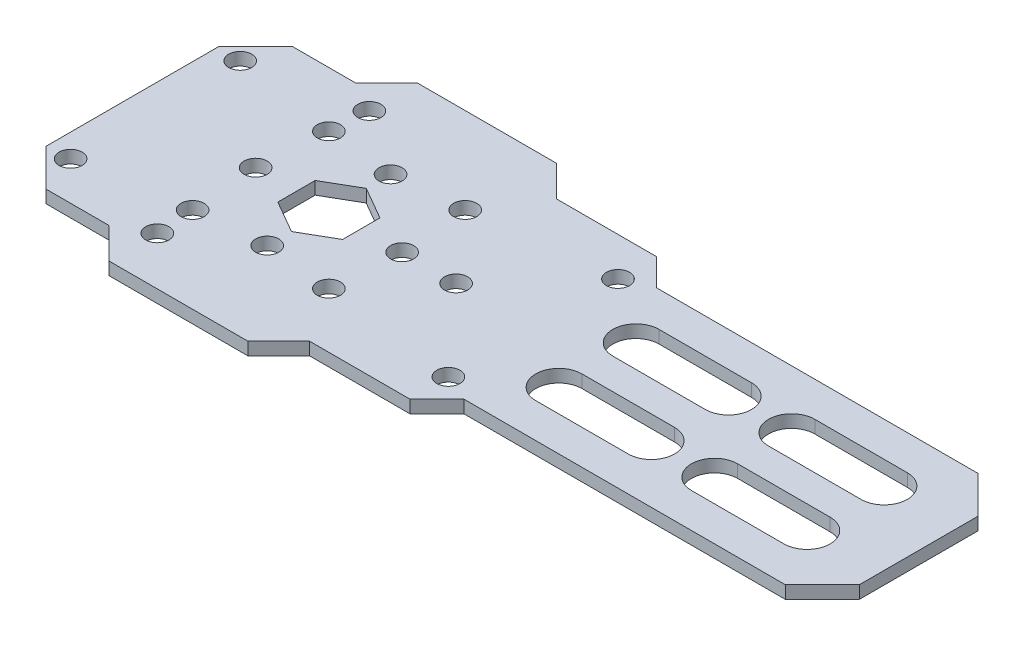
from build123d import *

# Parameters (mm, degrees)
BOSS_EXTRUDE1_DEPTH = 1.65
SKETCH2_R           = 1.5
CUT_EXTRUDE1_DEPTH  = 1.65


with BuildPart() as part:
    # Sketch1 → Boss-Extrude1 (new body)
    with BuildSketch(Plane(origin=(0, 0, 0), x_dir=(1, 0, 0), z_dir=(0, 1, 0))):
        Polygon((-106.347773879, 0.027300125), (-106.347773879, 16.034039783), (-123.347773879, 16.034039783), (-123.347773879, 4.835626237), (-118.539447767, 0.027300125), (-110.341034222, 0.027300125), align=None)
        Polygon((-123.347773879, 16.034039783), (-106.347773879, 16.034039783), (-106.347773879, 32.027300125), (-110.347773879, 32.027300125), (-118.539447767, 32.027300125), (-123.347773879, 27.218974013), align=None)
        Polygon((-106.347773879, 16.034039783), (-88.347773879, 16.034039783), (-88.347773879, 32.034039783), (-88.347773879, 36.034039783), (-106.347773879, 36.034039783), (-106.347773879, 32.027300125), align=None)
        Polygon((-88.347773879, 0.034039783), (-88.347773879, 16.034039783), (-106.347773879, 16.034039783), (-106.347773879, 0.027300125), (-106.347773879, -3.965960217), (-88.347773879, -3.965960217), align=None)
        Polygon((-71.347773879, 3.534039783), (-71.347773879, 16.034039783), (-88.347773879, 16.034039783), (-88.347773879, 0.034039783), (-84.347773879, 0.034039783), (-71.347773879, 0.034039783), align=None)
        Polygon((-88.347773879, 16.034039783), (-71.347773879, 16.034039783), (-71.347773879, 28.534039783), (-71.347773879, 32.034039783), (-84.347773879, 32.034039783), (-88.347773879, 32.034039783), align=None)
        Polygon((-71.347773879, 16.034039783), (-21.347773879, 16.034039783), (-21.347773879, 23.725713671), (-26.156099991, 28.534039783), (-67.847773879, 28.534039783), (-71.347773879, 28.534039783), align=None)
        Polygon((-21.347773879, 8.342365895), (-21.347773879, 16.034039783), (-71.347773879, 16.034039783), (-71.347773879, 3.534039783), (-67.847773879, 3.534039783), (-26.156099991, 3.534039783), align=None)
        Polygon((-67.847773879, 3.534039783), (-71.347773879, 3.534039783), (-71.347773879, 0.034039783), align=None)
        Polygon((-84.347773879, 0.034039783), (-88.347773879, 0.034039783), (-88.347773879, -3.965960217), align=None)
        Polygon((-106.347773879, -3.965960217), (-106.347773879, 0.027300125), (-110.341034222, 0.027300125), align=None)
        Polygon((-110.347773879, 32.027300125), (-106.347773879, 32.027300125), (-106.347773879, 36.034039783), align=None)
        Polygon((-88.347773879, 36.034039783), (-88.347773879, 32.034039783), (-84.347773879, 32.034039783), align=None)
        Polygon((-71.347773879, 32.034039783), (-71.347773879, 28.534039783), (-67.847773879, 28.534039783), align=None)
    extrude(amount=BOSS_EXTRUDE1_DEPTH)

    # Sketch2 → Cut-Extrude1 (cut)
    with BuildSketch(Plane(origin=(0, 1.65, 0), x_dir=(1, 0, 0), z_dir=(0, 1, 0))):
        with Locations(Location((-107.347773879, 16.027300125, 0), (0, 0, 270))):
            Circle(SKETCH2_R)
        with Locations(Location((-88.347773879, 16.027300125, 0), (0, 0, 270))):
            Circle(SKETCH2_R)
        with Locations(Location((-97.847773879, 24.027300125, 0), (0, 0, 270))):
            Circle(SKETCH2_R)
        with Locations(Location((-97.847773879, 8.027300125, 0), (0, 0, 270))):
            Circle(SKETCH2_R)
        with Locations(Location((-89.008939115, 7.18846536, 0), (0, 0, 270))):
            Circle(SKETCH2_R)
        with Locations(Location((-106.686608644, 24.86613489, 0), (0, 0, 270))):
            Circle(SKETCH2_R)
        with Locations(Location((-89.008939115, 24.86613489, 0), (0, 0, 270))):
            Circle(SKETCH2_R)
        with Locations(Location((-106.686608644, 7.18846536, 0), (0, 0, 270))):
            Circle(SKETCH2_R)
        with Locations(Location((-81.347773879, 16.027300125, 0), (0, 0, 270))):
            Circle(SKETCH2_R)
        with Locations(Location((-106.347773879, 29.777300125, 0), (0, 0, 270))):
            Circle(SKETCH2_R)
        with Locations(Location((-106.347773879, 2.277300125, 0), (0, 0, 270))):
            Circle(SKETCH2_R)
        with Locations(Location((-71.347773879, 27.027300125, 0), (0, 0, 270))):
            Circle(SKETCH2_R)
        with Locations(Location((-71.347773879, 5.027300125, 0), (0, 0, 270))):
            Circle(SKETCH2_R)
        with Locations(Location((-120.347773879, 27.027300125, 0), (0, 0, 270))):
            Circle(SKETCH2_R)
        with Locations(Location((-120.347773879, 5.027300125, 0), (0, 0, 270))):
            Circle(SKETCH2_R)
        Polygon((-97.847773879, 20.877300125), (-102.047997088, 18.452300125), (-102.047997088, 13.602300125), (-97.847773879, 11.177300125), (-93.647550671, 13.602300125), (-93.647550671, 18.452300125), align=None)
        with BuildLine():
            Line((-63.018882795, 24.027300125), (-51.018882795, 24.027300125))
            ThreePointArc((-51.018882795, 24.027300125), (-48.018882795, 21.027300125), (-51.018882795, 18.027300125))
            Line((-51.018882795, 18.027300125), (-63.018882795, 18.027300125))
            ThreePointArc((-63.018882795, 18.027300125), (-66.018882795, 21.027300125), (-63.018882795, 24.027300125))
        make_face()
        with BuildLine():
            Line((-63.018882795, 14.027300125), (-51.018882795, 14.027300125))
            ThreePointArc((-51.018882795, 14.027300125), (-48.018882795, 11.027300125), (-51.018882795, 8.027300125))
            Line((-51.018882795, 8.027300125), (-63.018882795, 8.027300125))
            ThreePointArc((-63.018882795, 8.027300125), (-66.018882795, 11.027300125), (-63.018882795, 14.027300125))
        make_face()
        with BuildLine():
            Line((-42.821608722, 24.027300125), (-30.821608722, 24.027300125))
            ThreePointArc((-30.821608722, 24.027300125), (-27.821608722, 21.027300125), (-30.821608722, 18.027300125))
            Line((-30.821608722, 18.027300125), (-42.821608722, 18.027300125))
            ThreePointArc((-42.821608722, 18.027300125), (-45.821608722, 21.027300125), (-42.821608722, 24.027300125))
        make_face()
        with BuildLine():
            Line((-42.821608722, 14.027300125), (-30.821608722, 14.027300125))
            ThreePointArc((-30.821608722, 14.027300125), (-27.821608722, 11.027300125), (-30.821608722, 8.027300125))
            Line((-30.821608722, 8.027300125), (-42.821608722, 8.027300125))
            ThreePointArc((-42.821608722, 8.027300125), (-45.821608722, 11.027300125), (-42.821608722, 14.027300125))
        make_face()
    extrude(amount=-CUT_EXTRUDE1_DEPTH, mode=Mode.SUBTRACT)


solid = part.part
